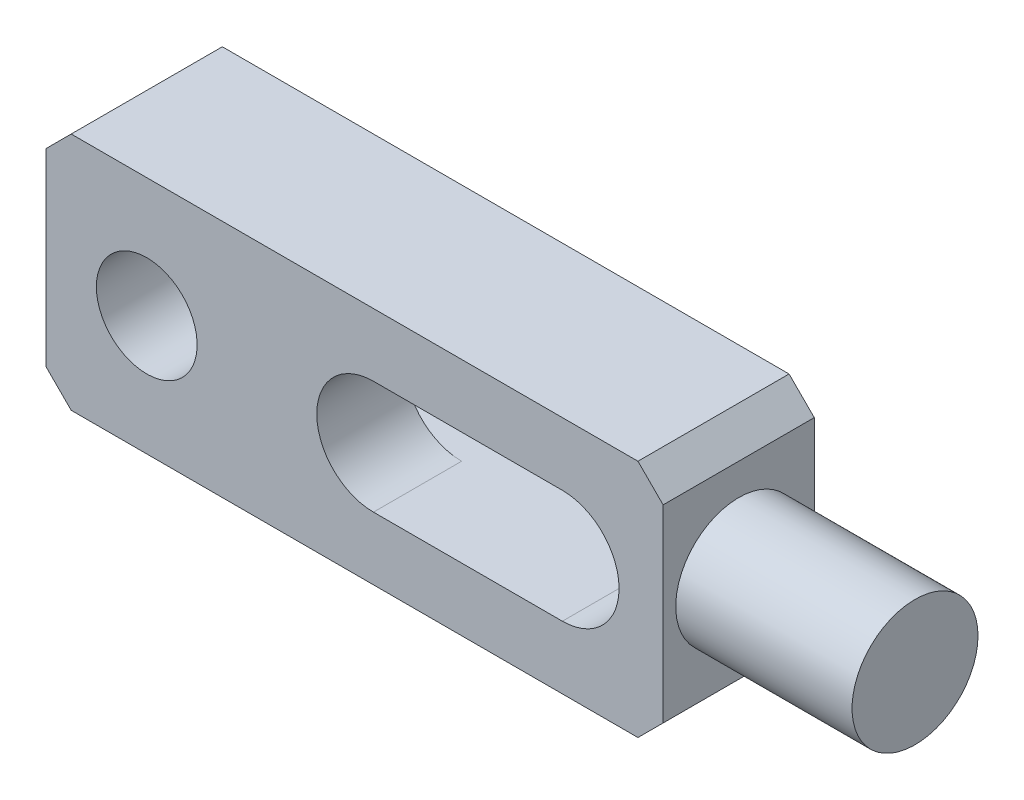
ISO-10303-21;
HEADER;
FILE_DESCRIPTION(('STEP AP214'),'2;1');
FILE_NAME('part.step','',(''),(''),'','','');
FILE_SCHEMA(('AUTOMOTIVE_DESIGN { 1 0 10303 214 1 1 1 1 }'));
ENDSEC;
DATA;
#1=APPLICATION_CONTEXT('core data for automotive mechanical design processes');
#2=APPLICATION_PROTOCOL_DEFINITION('international standard','automotive_design',2000,#1);
#3=PRODUCT_CONTEXT('',#1,'mechanical');
#4=PRODUCT('Part','Part','',(#3));
#5=PRODUCT_RELATED_PRODUCT_CATEGORY('part','',(#4));
#6=PRODUCT_DEFINITION_FORMATION('','',#4);
#7=PRODUCT_DEFINITION_CONTEXT('part definition',#1,'design');
#8=PRODUCT_DEFINITION('design','',#6,#7);
#9=PRODUCT_DEFINITION_SHAPE('','',#8);
#10=(LENGTH_UNIT() NAMED_UNIT(*) SI_UNIT(.MILLI.,.METRE.));
#11=(NAMED_UNIT(*) PLANE_ANGLE_UNIT() SI_UNIT($,.RADIAN.));
#12=(NAMED_UNIT(*) SI_UNIT($,.STERADIAN.) SOLID_ANGLE_UNIT());
#13=UNCERTAINTY_MEASURE_WITH_UNIT(LENGTH_MEASURE(1.E-05),#10,'distance_accuracy_value','');
#14=(GEOMETRIC_REPRESENTATION_CONTEXT(3) GLOBAL_UNCERTAINTY_ASSIGNED_CONTEXT((#13)) GLOBAL_UNIT_ASSIGNED_CONTEXT((#10,
#11,#12)) REPRESENTATION_CONTEXT('',''));
#15=CARTESIAN_POINT('',(0.,0.,0.));
#16=DIRECTION('',(0.,0.,1.));
#17=DIRECTION('',(1.,0.,0.));
#18=AXIS2_PLACEMENT_3D('',#15,#16,#17);
#19=CARTESIAN_POINT('',(-16.5,32.,0.));
#20=DIRECTION('',(0.,0.,-1.));
#21=DIRECTION('',(1.,0.,0.));
#22=AXIS2_PLACEMENT_3D('',#19,#20,#21);
#23=PLANE('',#22);
#24=DIRECTION('',(0.,-1.,0.));
#25=VECTOR('',#24,1.);
#26=CARTESIAN_POINT('',(-41.,7.5,0.));
#27=LINE('',#26,#25);
#28=CARTESIAN_POINT('',(-41.,-4.5,0.));
#29=VERTEX_POINT('',#28);
#30=CARTESIAN_POINT('',(-41.,-7.5,0.));
#31=VERTEX_POINT('',#30);
#32=EDGE_CURVE('E140',#29,#31,#27,.T.);
#33=ORIENTED_EDGE('',*,*,#32,.F.);
#34=DIRECTION('',(-1.,0.,0.));
#35=VECTOR('',#34,1.);
#36=CARTESIAN_POINT('',(0.,-4.5,0.));
#37=LINE('',#36,#35);
#38=CARTESIAN_POINT('',(0.,-4.5,0.));
#39=VERTEX_POINT('',#38);
#40=EDGE_CURVE('E279',#39,#29,#37,.T.);
#41=ORIENTED_EDGE('',*,*,#40,.F.);
#42=CARTESIAN_POINT('',(0.,0.,0.));
#43=DIRECTION('',(0.,0.,1.));
#44=DIRECTION('',(-1.,0.,0.));
#45=AXIS2_PLACEMENT_3D('',#42,#43,#44);
#46=CIRCLE('',#45,4.5);
#47=CARTESIAN_POINT('',(0.,4.5,0.));
#48=VERTEX_POINT('',#47);
#49=EDGE_CURVE('E123',#39,#48,#46,.T.);
#50=ORIENTED_EDGE('',*,*,#49,.T.);
#51=DIRECTION('',(1.,0.,0.));
#52=VECTOR('',#51,1.);
#53=CARTESIAN_POINT('',(-15.,4.5,0.));
#54=LINE('',#53,#52);
#55=CARTESIAN_POINT('',(-41.,4.5,0.));
#56=VERTEX_POINT('',#55);
#57=EDGE_CURVE('E115',#56,#48,#54,.T.);
#58=ORIENTED_EDGE('',*,*,#57,.F.);
#59=CARTESIAN_POINT('',(-41.,7.5,0.));
#60=VERTEX_POINT('',#59);
#61=EDGE_CURVE('E120',#60,#56,#27,.T.);
#62=ORIENTED_EDGE('',*,*,#61,.F.);
#63=DIRECTION('',(0.707106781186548,0.707106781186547,0.));
#64=VECTOR('',#63,1.);
#65=CARTESIAN_POINT('',(-41.,7.5,0.));
#66=LINE('',#65,#64);
#67=CARTESIAN_POINT('',(-39.,9.5,0.));
#68=VERTEX_POINT('',#67);
#69=EDGE_CURVE('E166',#60,#68,#66,.T.);
#70=ORIENTED_EDGE('',*,*,#69,.T.);
#71=DIRECTION('',(1.,0.,0.));
#72=VECTOR('',#71,1.);
#73=CARTESIAN_POINT('',(-39.,9.5,0.));
#74=LINE('',#73,#72);
#75=CARTESIAN_POINT('',(6.,9.5,0.));
#76=VERTEX_POINT('',#75);
#77=EDGE_CURVE('E163',#68,#76,#74,.T.);
#78=ORIENTED_EDGE('',*,*,#77,.T.);
#79=DIRECTION('',(0.707106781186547,-0.707106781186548,0.));
#80=VECTOR('',#79,1.);
#81=CARTESIAN_POINT('',(6.,9.5,0.));
#82=LINE('',#81,#80);
#83=CARTESIAN_POINT('',(8.,7.5,0.));
#84=VERTEX_POINT('',#83);
#85=EDGE_CURVE('E160',#76,#84,#82,.T.);
#86=ORIENTED_EDGE('',*,*,#85,.T.);
#87=DIRECTION('',(0.,-1.,0.));
#88=VECTOR('',#87,1.);
#89=CARTESIAN_POINT('',(8.,7.5,0.));
#90=LINE('',#89,#88);
#91=CARTESIAN_POINT('',(8.,-7.5,0.));
#92=VERTEX_POINT('',#91);
#93=EDGE_CURVE('E158',#84,#92,#90,.T.);
#94=ORIENTED_EDGE('',*,*,#93,.T.);
#95=DIRECTION('',(0.707106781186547,0.707106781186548,0.));
#96=VECTOR('',#95,1.);
#97=CARTESIAN_POINT('',(6.,-9.5,0.));
#98=LINE('',#97,#96);
#99=CARTESIAN_POINT('',(6.,-9.5,0.));
#100=VERTEX_POINT('',#99);
#101=EDGE_CURVE('E155',#100,#92,#98,.T.);
#102=ORIENTED_EDGE('',*,*,#101,.F.);
#103=DIRECTION('',(-1.,0.,0.));
#104=VECTOR('',#103,1.);
#105=CARTESIAN_POINT('',(6.,-9.5,0.));
#106=LINE('',#105,#104);
#107=CARTESIAN_POINT('',(-39.,-9.5,0.));
#108=VERTEX_POINT('',#107);
#109=EDGE_CURVE('E152',#100,#108,#106,.T.);
#110=ORIENTED_EDGE('',*,*,#109,.T.);
#111=DIRECTION('',(0.70710678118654,-0.707106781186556,0.));
#112=VECTOR('',#111,1.);
#113=CARTESIAN_POINT('',(-41.,-7.5,0.));
#114=LINE('',#113,#112);
#115=EDGE_CURVE('E145',#31,#108,#114,.T.);
#116=ORIENTED_EDGE('',*,*,#115,.F.);
#117=EDGE_LOOP('',(#33,#41,#50,#58,#62,#70,#78,#86,#94,#102,#110,#116));
#118=FACE_BOUND('',#117,.T.);
#119=ADVANCED_FACE('F14',(#118),#23,.T.);
#120=CARTESIAN_POINT('',(-41.,7.5,12.));
#121=DIRECTION('',(1.,0.,0.));
#122=DIRECTION('',(0.,0.,1.));
#123=AXIS2_PLACEMENT_3D('',#120,#121,#122);
#124=PLANE('',#123);
#125=DIRECTION('',(0.,0.,1.));
#126=VECTOR('',#125,1.);
#127=CARTESIAN_POINT('',(-41.,-4.5,12.));
#128=LINE('',#127,#126);
#129=CARTESIAN_POINT('',(-41.,-4.5,5.));
#130=VERTEX_POINT('',#129);
#131=EDGE_CURVE('E133',#29,#130,#128,.T.);
#132=ORIENTED_EDGE('',*,*,#131,.F.);
#133=ORIENTED_EDGE('',*,*,#32,.T.);
#134=DIRECTION('',(0.,0.,-1.));
#135=VECTOR('',#134,1.);
#136=CARTESIAN_POINT('',(-41.,-7.5,12.));
#137=LINE('',#136,#135);
#138=CARTESIAN_POINT('',(-41.,-7.5,12.));
#139=VERTEX_POINT('',#138);
#140=EDGE_CURVE('E22',#139,#31,#137,.T.);
#141=ORIENTED_EDGE('',*,*,#140,.F.);
#142=DIRECTION('',(0.,-1.,0.));
#143=VECTOR('',#142,1.);
#144=CARTESIAN_POINT('',(-41.,7.5,12.));
#145=LINE('',#144,#143);
#146=CARTESIAN_POINT('',(-41.,7.5,12.));
#147=VERTEX_POINT('',#146);
#148=EDGE_CURVE('E168',#147,#139,#145,.T.);
#149=ORIENTED_EDGE('',*,*,#148,.F.);
#150=DIRECTION('',(0.,0.,-1.));
#151=VECTOR('',#150,1.);
#152=CARTESIAN_POINT('',(-41.,7.5,12.));
#153=LINE('',#152,#151);
#154=EDGE_CURVE('E9',#147,#60,#153,.T.);
#155=ORIENTED_EDGE('',*,*,#154,.T.);
#156=ORIENTED_EDGE('',*,*,#61,.T.);
#157=DIRECTION('',(0.,0.,-1.));
#158=VECTOR('',#157,1.);
#159=CARTESIAN_POINT('',(-41.,4.5,12.));
#160=LINE('',#159,#158);
#161=CARTESIAN_POINT('',(-41.,4.5,5.));
#162=VERTEX_POINT('',#161);
#163=EDGE_CURVE('E128',#162,#56,#160,.T.);
#164=ORIENTED_EDGE('',*,*,#163,.F.);
#165=DIRECTION('',(0.,-1.,0.));
#166=VECTOR('',#165,1.);
#167=CARTESIAN_POINT('',(-41.,7.5,5.));
#168=LINE('',#167,#166);
#169=EDGE_CURVE('E134',#162,#130,#168,.T.);
#170=ORIENTED_EDGE('',*,*,#169,.T.);
#171=EDGE_LOOP('',(#132,#133,#141,#149,#155,#156,#164,#170));
#172=FACE_BOUND('',#171,.T.);
#173=ADVANCED_FACE('F16',(#172),#124,.F.);
#174=CARTESIAN_POINT('',(-16.5,32.,12.));
#175=DIRECTION('',(0.,0.,-1.));
#176=DIRECTION('',(1.,0.,0.));
#177=AXIS2_PLACEMENT_3D('',#174,#175,#176);
#178=PLANE('',#177);
#179=CARTESIAN_POINT('',(-33.,0.,12.));
#180=DIRECTION('',(0.,0.,1.));
#181=DIRECTION('',(-1.,0.,0.));
#182=AXIS2_PLACEMENT_3D('',#179,#180,#181);
#183=CIRCLE('',#182,4.);
#184=CARTESIAN_POINT('',(-37.,0.,12.));
#185=VERTEX_POINT('',#184);
#186=EDGE_CURVE('E148',#185,#185,#183,.T.);
#187=ORIENTED_EDGE('',*,*,#186,.F.);
#188=EDGE_LOOP('',(#187));
#189=FACE_BOUND('',#188,.T.);
#190=DIRECTION('',(0.707106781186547,0.707106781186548,0.));
#191=VECTOR('',#190,1.);
#192=CARTESIAN_POINT('',(6.,-9.5,12.));
#193=LINE('',#192,#191);
#194=CARTESIAN_POINT('',(6.,-9.5,12.));
#195=VERTEX_POINT('',#194);
#196=CARTESIAN_POINT('',(8.,-7.5,12.));
#197=VERTEX_POINT('',#196);
#198=EDGE_CURVE('E178',#195,#197,#193,.T.);
#199=ORIENTED_EDGE('',*,*,#198,.T.);
#200=DIRECTION('',(0.,-1.,0.));
#201=VECTOR('',#200,1.);
#202=CARTESIAN_POINT('',(8.,7.5,12.));
#203=LINE('',#202,#201);
#204=CARTESIAN_POINT('',(8.,7.5,12.));
#205=VERTEX_POINT('',#204);
#206=EDGE_CURVE('E181',#205,#197,#203,.T.);
#207=ORIENTED_EDGE('',*,*,#206,.F.);
#208=DIRECTION('',(0.707106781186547,-0.707106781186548,0.));
#209=VECTOR('',#208,1.);
#210=CARTESIAN_POINT('',(6.,9.5,12.));
#211=LINE('',#210,#209);
#212=CARTESIAN_POINT('',(6.,9.5,12.));
#213=VERTEX_POINT('',#212);
#214=EDGE_CURVE('E183',#213,#205,#211,.T.);
#215=ORIENTED_EDGE('',*,*,#214,.F.);
#216=DIRECTION('',(1.,0.,0.));
#217=VECTOR('',#216,1.);
#218=CARTESIAN_POINT('',(-39.,9.5,12.));
#219=LINE('',#218,#217);
#220=CARTESIAN_POINT('',(-39.,9.5,12.));
#221=VERTEX_POINT('',#220);
#222=EDGE_CURVE('E143',#221,#213,#219,.T.);
#223=ORIENTED_EDGE('',*,*,#222,.F.);
#224=DIRECTION('',(0.707106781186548,0.707106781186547,0.));
#225=VECTOR('',#224,1.);
#226=CARTESIAN_POINT('',(-41.,7.5,12.));
#227=LINE('',#226,#225);
#228=EDGE_CURVE('E139',#147,#221,#227,.T.);
#229=ORIENTED_EDGE('',*,*,#228,.F.);
#230=ORIENTED_EDGE('',*,*,#148,.T.);
#231=DIRECTION('',(0.70710678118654,-0.707106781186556,0.));
#232=VECTOR('',#231,1.);
#233=CARTESIAN_POINT('',(-41.,-7.5,12.));
#234=LINE('',#233,#232);
#235=CARTESIAN_POINT('',(-39.,-9.5,12.));
#236=VERTEX_POINT('',#235);
#237=EDGE_CURVE('E172',#139,#236,#234,.T.);
#238=ORIENTED_EDGE('',*,*,#237,.T.);
#239=DIRECTION('',(-1.,0.,0.));
#240=VECTOR('',#239,1.);
#241=CARTESIAN_POINT('',(6.,-9.5,12.));
#242=LINE('',#241,#240);
#243=EDGE_CURVE('E175',#195,#236,#242,.T.);
#244=ORIENTED_EDGE('',*,*,#243,.F.);
#245=EDGE_LOOP('',(#199,#207,#215,#223,#229,#230,#238,#244));
#246=FACE_BOUND('',#245,.T.);
#247=CARTESIAN_POINT('',(-15.,0.,12.));
#248=DIRECTION('',(0.,0.,1.));
#249=DIRECTION('',(-1.,0.,0.));
#250=AXIS2_PLACEMENT_3D('',#247,#248,#249);
#251=CIRCLE('',#250,4.5);
#252=CARTESIAN_POINT('',(-15.,4.5,12.));
#253=VERTEX_POINT('',#252);
#254=CARTESIAN_POINT('',(-15.,-4.5,12.));
#255=VERTEX_POINT('',#254);
#256=EDGE_CURVE('E125',#253,#255,#251,.T.);
#257=ORIENTED_EDGE('',*,*,#256,.F.);
#258=DIRECTION('',(1.,0.,0.));
#259=VECTOR('',#258,1.);
#260=CARTESIAN_POINT('',(-15.,4.5,12.));
#261=LINE('',#260,#259);
#262=CARTESIAN_POINT('',(0.,4.5,12.));
#263=VERTEX_POINT('',#262);
#264=EDGE_CURVE('E285',#253,#263,#261,.T.);
#265=ORIENTED_EDGE('',*,*,#264,.T.);
#266=CARTESIAN_POINT('',(0.,0.,12.));
#267=DIRECTION('',(0.,0.,1.));
#268=DIRECTION('',(-1.,0.,0.));
#269=AXIS2_PLACEMENT_3D('',#266,#267,#268);
#270=CIRCLE('',#269,4.5);
#271=CARTESIAN_POINT('',(0.,-4.5,12.));
#272=VERTEX_POINT('',#271);
#273=EDGE_CURVE('E37',#272,#263,#270,.T.);
#274=ORIENTED_EDGE('',*,*,#273,.F.);
#275=DIRECTION('',(-1.,0.,0.));
#276=VECTOR('',#275,1.);
#277=CARTESIAN_POINT('',(0.,-4.5,12.));
#278=LINE('',#277,#276);
#279=EDGE_CURVE('E290',#272,#255,#278,.T.);
#280=ORIENTED_EDGE('',*,*,#279,.T.);
#281=EDGE_LOOP('',(#257,#265,#274,#280));
#282=FACE_BOUND('',#281,.T.);
#283=ADVANCED_FACE('F211',(#189,#246,#282),#178,.F.);
#284=CARTESIAN_POINT('',(-41.,7.5,12.));
#285=DIRECTION('',(-0.707106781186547,0.707106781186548,0.));
#286=DIRECTION('',(-0.707106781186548,-0.707106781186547,0.));
#287=AXIS2_PLACEMENT_3D('',#284,#285,#286);
#288=PLANE('',#287);
#289=ORIENTED_EDGE('',*,*,#154,.F.);
#290=ORIENTED_EDGE('',*,*,#228,.T.);
#291=DIRECTION('',(0.,0.,-1.));
#292=VECTOR('',#291,1.);
#293=CARTESIAN_POINT('',(-39.,9.5,12.));
#294=LINE('',#293,#292);
#295=EDGE_CURVE('E171',#221,#68,#294,.T.);
#296=ORIENTED_EDGE('',*,*,#295,.T.);
#297=ORIENTED_EDGE('',*,*,#69,.F.);
#298=EDGE_LOOP('',(#289,#290,#296,#297));
#299=FACE_BOUND('',#298,.T.);
#300=ADVANCED_FACE('F217',(#299),#288,.T.);
#301=CARTESIAN_POINT('',(-41.,-7.5,12.));
#302=DIRECTION('',(0.707106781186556,0.707106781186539,0.));
#303=DIRECTION('',(-0.70710678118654,0.707106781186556,0.));
#304=AXIS2_PLACEMENT_3D('',#301,#302,#303);
#305=PLANE('',#304);
#306=DIRECTION('',(0.,0.,-1.));
#307=VECTOR('',#306,1.);
#308=CARTESIAN_POINT('',(-39.,-9.5,12.));
#309=LINE('',#308,#307);
#310=EDGE_CURVE('E198',#236,#108,#309,.T.);
#311=ORIENTED_EDGE('',*,*,#310,.F.);
#312=ORIENTED_EDGE('',*,*,#237,.F.);
#313=ORIENTED_EDGE('',*,*,#140,.T.);
#314=ORIENTED_EDGE('',*,*,#115,.T.);
#315=EDGE_LOOP('',(#311,#312,#313,#314));
#316=FACE_BOUND('',#315,.T.);
#317=ADVANCED_FACE('F203',(#316),#305,.F.);
#318=CARTESIAN_POINT('',(6.,-9.5,12.));
#319=DIRECTION('',(0.,-1.,0.));
#320=DIRECTION('',(1.,0.,0.));
#321=AXIS2_PLACEMENT_3D('',#318,#319,#320);
#322=PLANE('',#321);
#323=DIRECTION('',(0.,0.,-1.));
#324=VECTOR('',#323,1.);
#325=CARTESIAN_POINT('',(6.,-9.5,12.));
#326=LINE('',#325,#324);
#327=EDGE_CURVE('E196',#195,#100,#326,.T.);
#328=ORIENTED_EDGE('',*,*,#327,.F.);
#329=ORIENTED_EDGE('',*,*,#243,.T.);
#330=ORIENTED_EDGE('',*,*,#310,.T.);
#331=ORIENTED_EDGE('',*,*,#109,.F.);
#332=EDGE_LOOP('',(#328,#329,#330,#331));
#333=FACE_BOUND('',#332,.T.);
#334=ADVANCED_FACE('F207',(#333),#322,.T.);
#335=CARTESIAN_POINT('',(6.,-9.5,12.));
#336=DIRECTION('',(-0.707106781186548,0.707106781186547,0.));
#337=DIRECTION('',(-0.707106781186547,-0.707106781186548,0.));
#338=AXIS2_PLACEMENT_3D('',#335,#336,#337);
#339=PLANE('',#338);
#340=DIRECTION('',(0.,0.,-1.));
#341=VECTOR('',#340,1.);
#342=CARTESIAN_POINT('',(8.,-7.5,12.));
#343=LINE('',#342,#341);
#344=EDGE_CURVE('E193',#197,#92,#343,.T.);
#345=ORIENTED_EDGE('',*,*,#344,.F.);
#346=ORIENTED_EDGE('',*,*,#198,.F.);
#347=ORIENTED_EDGE('',*,*,#327,.T.);
#348=ORIENTED_EDGE('',*,*,#101,.T.);
#349=EDGE_LOOP('',(#345,#346,#347,#348));
#350=FACE_BOUND('',#349,.T.);
#351=ADVANCED_FACE('F231',(#350),#339,.F.);
#352=CARTESIAN_POINT('',(8.,7.5,12.));
#353=DIRECTION('',(1.,0.,0.));
#354=DIRECTION('',(0.,0.,1.));
#355=AXIS2_PLACEMENT_3D('',#352,#353,#354);
#356=PLANE('',#355);
#357=DIRECTION('',(0.,0.,-1.));
#358=VECTOR('',#357,1.);
#359=CARTESIAN_POINT('',(8.,7.5,12.));
#360=LINE('',#359,#358);
#361=EDGE_CURVE('E191',#205,#84,#360,.T.);
#362=ORIENTED_EDGE('',*,*,#361,.F.);
#363=ORIENTED_EDGE('',*,*,#206,.T.);
#364=ORIENTED_EDGE('',*,*,#344,.T.);
#365=ORIENTED_EDGE('',*,*,#93,.F.);
#366=EDGE_LOOP('',(#362,#363,#364,#365));
#367=FACE_BOUND('',#366,.T.);
#368=CARTESIAN_POINT('',(8.,0.,6.));
#369=DIRECTION('',(-1.,0.,0.));
#370=DIRECTION('',(0.,0.,-1.));
#371=AXIS2_PLACEMENT_3D('',#368,#369,#370);
#372=CIRCLE('',#371,5.);
#373=CARTESIAN_POINT('',(8.,0.,1.));
#374=VERTEX_POINT('',#373);
#375=EDGE_CURVE('E276',#374,#374,#372,.T.);
#376=ORIENTED_EDGE('',*,*,#375,.T.);
#377=EDGE_LOOP('',(#376));
#378=FACE_BOUND('',#377,.T.);
#379=ADVANCED_FACE('F227',(#367,#378),#356,.T.);
#380=CARTESIAN_POINT('',(6.,9.5,12.));
#381=DIRECTION('',(0.707106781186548,0.707106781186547,0.));
#382=DIRECTION('',(-0.707106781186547,0.707106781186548,0.));
#383=AXIS2_PLACEMENT_3D('',#380,#381,#382);
#384=PLANE('',#383);
#385=DIRECTION('',(0.,0.,-1.));
#386=VECTOR('',#385,1.);
#387=CARTESIAN_POINT('',(6.,9.5,12.));
#388=LINE('',#387,#386);
#389=EDGE_CURVE('E189',#213,#76,#388,.T.);
#390=ORIENTED_EDGE('',*,*,#389,.F.);
#391=ORIENTED_EDGE('',*,*,#214,.T.);
#392=ORIENTED_EDGE('',*,*,#361,.T.);
#393=ORIENTED_EDGE('',*,*,#85,.F.);
#394=EDGE_LOOP('',(#390,#391,#392,#393));
#395=FACE_BOUND('',#394,.T.);
#396=ADVANCED_FACE('F223',(#395),#384,.T.);
#397=CARTESIAN_POINT('',(-39.,9.5,12.));
#398=DIRECTION('',(0.,1.,0.));
#399=DIRECTION('',(-1.,0.,0.));
#400=AXIS2_PLACEMENT_3D('',#397,#398,#399);
#401=PLANE('',#400);
#402=ORIENTED_EDGE('',*,*,#222,.T.);
#403=ORIENTED_EDGE('',*,*,#389,.T.);
#404=ORIENTED_EDGE('',*,*,#77,.F.);
#405=ORIENTED_EDGE('',*,*,#295,.F.);
#406=EDGE_LOOP('',(#402,#403,#404,#405));
#407=FACE_BOUND('',#406,.T.);
#408=ADVANCED_FACE('F221',(#407),#401,.T.);
#409=CARTESIAN_POINT('',(-33.,0.,12.));
#410=DIRECTION('',(0.,0.,-1.));
#411=DIRECTION('',(1.,0.,0.));
#412=AXIS2_PLACEMENT_3D('',#409,#410,#411);
#413=CYLINDRICAL_SURFACE('',#412,4.);
#414=CARTESIAN_POINT('',(-33.,0.,5.));
#415=DIRECTION('',(0.,0.,1.));
#416=DIRECTION('',(-1.,0.,0.));
#417=AXIS2_PLACEMENT_3D('',#414,#415,#416);
#418=CIRCLE('',#417,4.);
#419=CARTESIAN_POINT('',(-37.,0.,5.));
#420=VERTEX_POINT('',#419);
#421=EDGE_CURVE('E315',#420,#420,#418,.T.);
#422=ORIENTED_EDGE('',*,*,#421,.F.);
#423=EDGE_LOOP('',(#422));
#424=FACE_BOUND('',#423,.T.);
#425=ORIENTED_EDGE('',*,*,#186,.T.);
#426=EDGE_LOOP('',(#425));
#427=FACE_BOUND('',#426,.T.);
#428=ADVANCED_FACE('F249',(#424,#427),#413,.F.);
#429=CARTESIAN_POINT('',(-15.,0.,12.));
#430=DIRECTION('',(0.,0.,-1.));
#431=DIRECTION('',(1.,0.,0.));
#432=AXIS2_PLACEMENT_3D('',#429,#430,#431);
#433=CYLINDRICAL_SURFACE('',#432,4.5);
#434=CARTESIAN_POINT('',(-15.,0.,5.));
#435=DIRECTION('',(0.,0.,1.));
#436=DIRECTION('',(-1.,0.,0.));
#437=AXIS2_PLACEMENT_3D('',#434,#435,#436);
#438=CIRCLE('',#437,4.5);
#439=CARTESIAN_POINT('',(-15.,4.5,5.));
#440=VERTEX_POINT('',#439);
#441=CARTESIAN_POINT('',(-15.,-4.5,5.));
#442=VERTEX_POINT('',#441);
#443=EDGE_CURVE('E316',#440,#442,#438,.T.);
#444=ORIENTED_EDGE('',*,*,#443,.F.);
#445=DIRECTION('',(0.,0.,-1.));
#446=VECTOR('',#445,1.);
#447=CARTESIAN_POINT('',(-15.,4.5,12.));
#448=LINE('',#447,#446);
#449=EDGE_CURVE('E288',#253,#440,#448,.T.);
#450=ORIENTED_EDGE('',*,*,#449,.F.);
#451=ORIENTED_EDGE('',*,*,#256,.T.);
#452=DIRECTION('',(0.,0.,-1.));
#453=VECTOR('',#452,1.);
#454=CARTESIAN_POINT('',(-15.,-4.5,12.));
#455=LINE('',#454,#453);
#456=EDGE_CURVE('E299',#255,#442,#455,.T.);
#457=ORIENTED_EDGE('',*,*,#456,.T.);
#458=EDGE_LOOP('',(#444,#450,#451,#457));
#459=FACE_BOUND('',#458,.T.);
#460=ADVANCED_FACE('F306',(#459),#433,.F.);
#461=CARTESIAN_POINT('',(0.,-4.5,12.));
#462=DIRECTION('',(0.,-1.,0.));
#463=DIRECTION('',(1.,0.,0.));
#464=AXIS2_PLACEMENT_3D('',#461,#462,#463);
#465=PLANE('',#464);
#466=ORIENTED_EDGE('',*,*,#40,.T.);
#467=ORIENTED_EDGE('',*,*,#131,.T.);
#468=DIRECTION('',(1.,0.,0.));
#469=VECTOR('',#468,1.);
#470=CARTESIAN_POINT('',(-48.,-4.5,5.));
#471=LINE('',#470,#469);
#472=EDGE_CURVE('E321',#130,#442,#471,.T.);
#473=ORIENTED_EDGE('',*,*,#472,.T.);
#474=ORIENTED_EDGE('',*,*,#456,.F.);
#475=ORIENTED_EDGE('',*,*,#279,.F.);
#476=DIRECTION('',(0.,0.,-1.));
#477=VECTOR('',#476,1.);
#478=CARTESIAN_POINT('',(0.,-4.5,12.));
#479=LINE('',#478,#477);
#480=EDGE_CURVE('E298',#272,#39,#479,.T.);
#481=ORIENTED_EDGE('',*,*,#480,.T.);
#482=EDGE_LOOP('',(#466,#467,#473,#474,#475,#481));
#483=FACE_BOUND('',#482,.T.);
#484=ADVANCED_FACE('F311',(#483),#465,.F.);
#485=CARTESIAN_POINT('',(0.,0.,12.));
#486=DIRECTION('',(0.,0.,-1.));
#487=DIRECTION('',(1.,0.,0.));
#488=AXIS2_PLACEMENT_3D('',#485,#486,#487);
#489=CYLINDRICAL_SURFACE('',#488,4.5);
#490=DIRECTION('',(0.,0.,-1.));
#491=VECTOR('',#490,1.);
#492=CARTESIAN_POINT('',(0.,4.5,12.));
#493=LINE('',#492,#491);
#494=EDGE_CURVE('E296',#263,#48,#493,.T.);
#495=ORIENTED_EDGE('',*,*,#494,.T.);
#496=ORIENTED_EDGE('',*,*,#49,.F.);
#497=ORIENTED_EDGE('',*,*,#480,.F.);
#498=ORIENTED_EDGE('',*,*,#273,.T.);
#499=EDGE_LOOP('',(#495,#496,#497,#498));
#500=FACE_BOUND('',#499,.T.);
#501=ADVANCED_FACE('F329',(#500),#489,.F.);
#502=CARTESIAN_POINT('',(-15.,4.5,12.));
#503=DIRECTION('',(0.,1.,0.));
#504=DIRECTION('',(-1.,0.,0.));
#505=AXIS2_PLACEMENT_3D('',#502,#503,#504);
#506=PLANE('',#505);
#507=ORIENTED_EDGE('',*,*,#57,.T.);
#508=ORIENTED_EDGE('',*,*,#494,.F.);
#509=ORIENTED_EDGE('',*,*,#264,.F.);
#510=ORIENTED_EDGE('',*,*,#449,.T.);
#511=DIRECTION('',(-1.,0.,0.));
#512=VECTOR('',#511,1.);
#513=CARTESIAN_POINT('',(-8.,4.5,5.));
#514=LINE('',#513,#512);
#515=EDGE_CURVE('E29',#440,#162,#514,.T.);
#516=ORIENTED_EDGE('',*,*,#515,.T.);
#517=ORIENTED_EDGE('',*,*,#163,.T.);
#518=EDGE_LOOP('',(#507,#508,#509,#510,#516,#517));
#519=FACE_BOUND('',#518,.T.);
#520=ADVANCED_FACE('F129',(#519),#506,.F.);
#521=CARTESIAN_POINT('',(8.,0.,6.));
#522=DIRECTION('',(1.,0.,0.));
#523=DIRECTION('',(0.,0.,1.));
#524=AXIS2_PLACEMENT_3D('',#521,#522,#523);
#525=CYLINDRICAL_SURFACE('',#524,5.);
#526=ORIENTED_EDGE('',*,*,#375,.F.);
#527=EDGE_LOOP('',(#526));
#528=FACE_BOUND('',#527,.T.);
#529=CARTESIAN_POINT('',(22.,0.,6.));
#530=DIRECTION('',(-1.,0.,0.));
#531=DIRECTION('',(0.,0.,-1.));
#532=AXIS2_PLACEMENT_3D('',#529,#530,#531);
#533=CIRCLE('',#532,5.);
#534=CARTESIAN_POINT('',(22.,0.,1.));
#535=VERTEX_POINT('',#534);
#536=EDGE_CURVE('E274',#535,#535,#533,.T.);
#537=ORIENTED_EDGE('',*,*,#536,.T.);
#538=EDGE_LOOP('',(#537));
#539=FACE_BOUND('',#538,.T.);
#540=ADVANCED_FACE('F262',(#528,#539),#525,.T.);
#541=CARTESIAN_POINT('',(22.,-6.,12.));
#542=DIRECTION('',(-1.,0.,0.));
#543=DIRECTION('',(0.,0.,-1.));
#544=AXIS2_PLACEMENT_3D('',#541,#542,#543);
#545=PLANE('',#544);
#546=ORIENTED_EDGE('',*,*,#536,.F.);
#547=EDGE_LOOP('',(#546));
#548=FACE_BOUND('',#547,.T.);
#549=ADVANCED_FACE('F259',(#548),#545,.F.);
#550=CARTESIAN_POINT('',(-48.,-4.5,5.));
#551=DIRECTION('',(0.,0.,1.));
#552=DIRECTION('',(-1.,0.,0.));
#553=AXIS2_PLACEMENT_3D('',#550,#551,#552);
#554=PLANE('',#553);
#555=ORIENTED_EDGE('',*,*,#421,.T.);
#556=EDGE_LOOP('',(#555));
#557=FACE_BOUND('',#556,.T.);
#558=ORIENTED_EDGE('',*,*,#515,.F.);
#559=ORIENTED_EDGE('',*,*,#443,.T.);
#560=ORIENTED_EDGE('',*,*,#472,.F.);
#561=ORIENTED_EDGE('',*,*,#169,.F.);
#562=EDGE_LOOP('',(#558,#559,#560,#561));
#563=FACE_BOUND('',#562,.T.);
#564=ADVANCED_FACE('F261',(#557,#563),#554,.F.);
#565=CLOSED_SHELL('',(#119,#173,#283,#300,#317,#334,#351,#379,#396,#408,#428,#460,#484,#501,
#520,#540,#549,#564));
#566=MANIFOLD_SOLID_BREP('B1',#565);
#567=ADVANCED_BREP_SHAPE_REPRESENTATION('',(#18,#566),#14);
#568=SHAPE_DEFINITION_REPRESENTATION(#9,#567);
ENDSEC;
END-ISO-10303-21;
